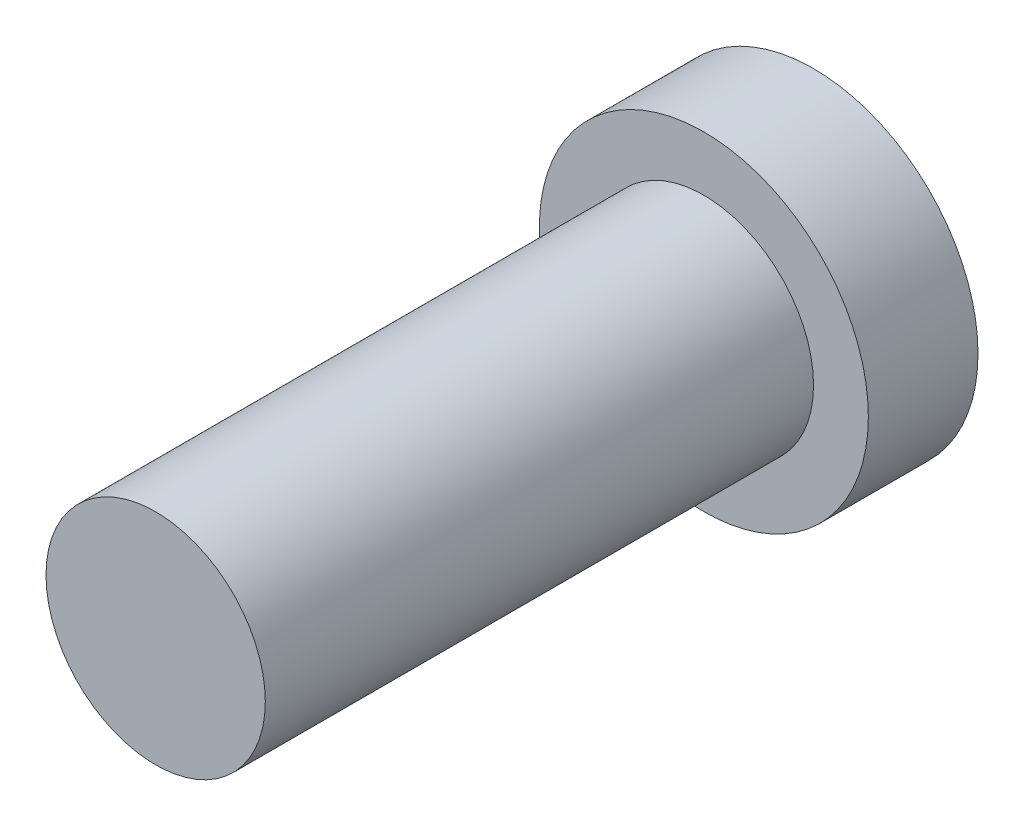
ISO-10303-21;
HEADER;
FILE_DESCRIPTION(('STEP AP214'),'2;1');
FILE_NAME('part.step','',(''),(''),'','','');
FILE_SCHEMA(('AUTOMOTIVE_DESIGN { 1 0 10303 214 1 1 1 1 }'));
ENDSEC;
DATA;
#1=APPLICATION_CONTEXT('core data for automotive mechanical design processes');
#2=APPLICATION_PROTOCOL_DEFINITION('international standard','automotive_design',2000,#1);
#3=PRODUCT_CONTEXT('',#1,'mechanical');
#4=PRODUCT('Part','Part','',(#3));
#5=PRODUCT_RELATED_PRODUCT_CATEGORY('part','',(#4));
#6=PRODUCT_DEFINITION_FORMATION('','',#4);
#7=PRODUCT_DEFINITION_CONTEXT('part definition',#1,'design');
#8=PRODUCT_DEFINITION('design','',#6,#7);
#9=PRODUCT_DEFINITION_SHAPE('','',#8);
#10=(LENGTH_UNIT() NAMED_UNIT(*) SI_UNIT(.MILLI.,.METRE.));
#11=(NAMED_UNIT(*) PLANE_ANGLE_UNIT() SI_UNIT($,.RADIAN.));
#12=(NAMED_UNIT(*) SI_UNIT($,.STERADIAN.) SOLID_ANGLE_UNIT());
#13=UNCERTAINTY_MEASURE_WITH_UNIT(LENGTH_MEASURE(1.E-05),#10,'distance_accuracy_value','');
#14=(GEOMETRIC_REPRESENTATION_CONTEXT(3) GLOBAL_UNCERTAINTY_ASSIGNED_CONTEXT((#13)) GLOBAL_UNIT_ASSIGNED_CONTEXT((#10,
#11,#12)) REPRESENTATION_CONTEXT('',''));
#15=CARTESIAN_POINT('',(0.,0.,0.));
#16=DIRECTION('',(0.,0.,1.));
#17=DIRECTION('',(1.,0.,0.));
#18=AXIS2_PLACEMENT_3D('',#15,#16,#17);
#19=CARTESIAN_POINT('',(10.,0.,0.));
#20=DIRECTION('',(0.,0.,1.));
#21=DIRECTION('',(1.,0.,0.));
#22=AXIS2_PLACEMENT_3D('',#19,#20,#21);
#23=PLANE('',#22);
#24=CARTESIAN_POINT('',(0.,0.,0.));
#25=DIRECTION('',(0.,0.,1.));
#26=DIRECTION('',(1.,0.,0.));
#27=AXIS2_PLACEMENT_3D('',#24,#25,#26);
#28=CIRCLE('',#27,10.);
#29=CARTESIAN_POINT('',(10.,0.,0.));
#30=VERTEX_POINT('',#29);
#31=EDGE_CURVE('E47',#30,#30,#28,.T.);
#32=ORIENTED_EDGE('',*,*,#31,.T.);
#33=EDGE_LOOP('',(#32));
#34=FACE_BOUND('',#33,.T.);
#35=ADVANCED_FACE('F33',(#34),#23,.T.);
#36=CARTESIAN_POINT('',(0.,0.,-60.));
#37=DIRECTION('',(0.,0.,-1.));
#38=DIRECTION('',(-1.,0.,0.));
#39=AXIS2_PLACEMENT_3D('',#36,#37,#38);
#40=PLANE('',#39);
#41=CARTESIAN_POINT('',(0.,0.,-60.));
#42=DIRECTION('',(0.,0.,1.));
#43=DIRECTION('',(1.,0.,0.));
#44=AXIS2_PLACEMENT_3D('',#41,#42,#43);
#45=CIRCLE('',#44,15.);
#46=CARTESIAN_POINT('',(15.,0.,-60.));
#47=VERTEX_POINT('',#46);
#48=EDGE_CURVE('E10',#47,#47,#45,.T.);
#49=ORIENTED_EDGE('',*,*,#48,.F.);
#50=EDGE_LOOP('',(#49));
#51=FACE_BOUND('',#50,.T.);
#52=ADVANCED_FACE('F65',(#51),#40,.T.);
#53=CARTESIAN_POINT('',(0.,0.,0.));
#54=DIRECTION('',(0.,0.,1.));
#55=DIRECTION('',(1.,0.,0.));
#56=AXIS2_PLACEMENT_3D('',#53,#54,#55);
#57=CYLINDRICAL_SURFACE('',#56,15.);
#58=ORIENTED_EDGE('',*,*,#48,.T.);
#59=EDGE_LOOP('',(#58));
#60=FACE_BOUND('',#59,.T.);
#61=CARTESIAN_POINT('',(0.,0.,-50.));
#62=DIRECTION('',(0.,0.,1.));
#63=DIRECTION('',(1.,0.,0.));
#64=AXIS2_PLACEMENT_3D('',#61,#62,#63);
#65=CIRCLE('',#64,15.);
#66=CARTESIAN_POINT('',(15.,0.,-50.));
#67=VERTEX_POINT('',#66);
#68=EDGE_CURVE('E39',#67,#67,#65,.T.);
#69=ORIENTED_EDGE('',*,*,#68,.F.);
#70=EDGE_LOOP('',(#69));
#71=FACE_BOUND('',#70,.T.);
#72=ADVANCED_FACE('F62',(#60,#71),#57,.T.);
#73=CARTESIAN_POINT('',(15.,0.,-50.));
#74=DIRECTION('',(0.,0.,1.));
#75=DIRECTION('',(1.,0.,0.));
#76=AXIS2_PLACEMENT_3D('',#73,#74,#75);
#77=PLANE('',#76);
#78=ORIENTED_EDGE('',*,*,#68,.T.);
#79=EDGE_LOOP('',(#78));
#80=FACE_BOUND('',#79,.T.);
#81=CARTESIAN_POINT('',(0.,0.,-50.));
#82=DIRECTION('',(0.,0.,1.));
#83=DIRECTION('',(1.,0.,0.));
#84=AXIS2_PLACEMENT_3D('',#81,#82,#83);
#85=CIRCLE('',#84,9.99999999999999);
#86=CARTESIAN_POINT('',(9.99999999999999,0.,-50.));
#87=VERTEX_POINT('',#86);
#88=EDGE_CURVE('E43',#87,#87,#85,.T.);
#89=ORIENTED_EDGE('',*,*,#88,.F.);
#90=EDGE_LOOP('',(#89));
#91=FACE_BOUND('',#90,.T.);
#92=ADVANCED_FACE('F56',(#80,#91),#77,.T.);
#93=CARTESIAN_POINT('',(0.,0.,0.));
#94=DIRECTION('',(0.,0.,1.));
#95=DIRECTION('',(1.,0.,0.));
#96=AXIS2_PLACEMENT_3D('',#93,#94,#95);
#97=CYLINDRICAL_SURFACE('',#96,10.);
#98=ORIENTED_EDGE('',*,*,#88,.T.);
#99=EDGE_LOOP('',(#98));
#100=FACE_BOUND('',#99,.T.);
#101=ORIENTED_EDGE('',*,*,#31,.F.);
#102=EDGE_LOOP('',(#101));
#103=FACE_BOUND('',#102,.T.);
#104=ADVANCED_FACE('F54',(#100,#103),#97,.T.);
#105=CLOSED_SHELL('',(#35,#52,#72,#92,#104));
#106=MANIFOLD_SOLID_BREP('B2',#105);
#107=ADVANCED_BREP_SHAPE_REPRESENTATION('',(#18,#106),#14);
#108=SHAPE_DEFINITION_REPRESENTATION(#9,#107);
ENDSEC;
END-ISO-10303-21;
